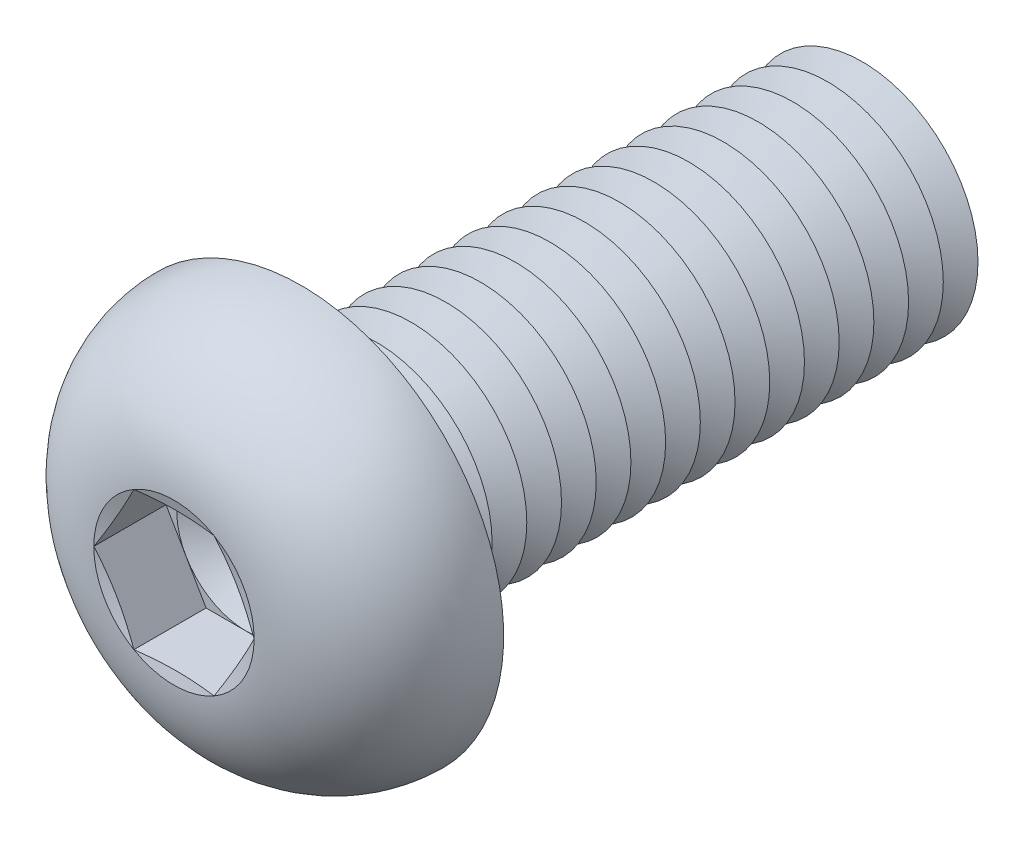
from build123d import *

# Parameters (mm, degrees)
FILLET1_R          = 0.75
LPATTERN1_COUNT    = 16
LPATTERN1_PITCH    = 1.5
CUT_EXTRUDE1_DEPTH = 3.12


with BuildPart() as part:
    # Sketch1 → Revolve1 (revolve)
    with BuildSketch(Plane(origin=(0, 0, 0), x_dir=(0, 0, -1), z_dir=(1, 0, 0)), mode=Mode.PRIVATE) as revolve1_sk:
        with BuildLine():
            Line((0, 5), (0, 8.75))
            ThreePointArc((0, 8.75), (-3.814142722, 7.21429474), (-5.5, 3.4641))
            Line((-5.5, 3.4641), (-5.035898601, 1.73205))
            Line((-5.035898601, 1.73205), (-5.5, 1.73205))
            Line((-5.5, 1.73205), (-5.5, 0))
            Line((-5.5, 0), (25, 0))
            Line((25, 0), (25, 5))
            Line((25, 5), (0, 5))
        make_face()
    revolve(revolve1_sk.sketch.rotate(Axis((0, 0, -25), (0, 0, 1)), 90), axis=Axis((0, 0, -25), (0, 0, 1)))

    # Fillet1
    fillet1_edges = [part.edges().sort_by_distance(p)[0] for p in [
        (5, 0, 0),
    ]]
    fillet(fillet1_edges, radius=FILLET1_R)

    # Sketch2 → Cut-Revolve1 (revolve, cut)
    with BuildSketch(Plane(origin=(0, 0, 0), x_dir=(0, 0, -1), z_dir=(1, 0, 0)), mode=Mode.PRIVATE) as cut_revolve1_sk:
        Polygon((24.25, 5), (25.75, 5), (25, 3.700961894), align=None)
    cut_revolve1 = revolve(cut_revolve1_sk.sketch.rotate(Axis((0, 0, -25), (0, 0, -1)), 270), axis=Axis((0, 0, -25), (0, 0, -1)), mode=Mode.SUBTRACT)

    # LPattern1: Cut-Revolve1 ×16
    with Locations(*[(0, 0, i * LPATTERN1_PITCH) for i in range(1, LPATTERN1_COUNT)]):
        add(cut_revolve1, mode=Mode.SUBTRACT)

    # Sketch3 → Cut-Extrude1 (cut)
    with BuildSketch(Plane.XY.offset(5.5)):
        Polygon((1.73205, 2.999998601), (-1.73205, 2.999998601), (-3.4641, 0), (-1.73205, -2.999998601), (1.73205, -2.999998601), (3.4641, 0), align=None)
    extrude(amount=-CUT_EXTRUDE1_DEPTH, mode=Mode.SUBTRACT)

    # Cut-Extrude2 cone 1 section (on through the dimple's axis) → Cut-Extrude2 (revolve, cut)
    with BuildSketch(Plane(origin=(0, 0, 2.38), x_dir=(0, -1, 0), z_dir=(1, 0, 0))):
        Polygon((0, 0), (2.999998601, 0), (0, 1.73205), align=None)
    revolve(axis=Axis((0, 0, 2.38), (0, 0, -1)), mode=Mode.SUBTRACT)


solid = part.part
